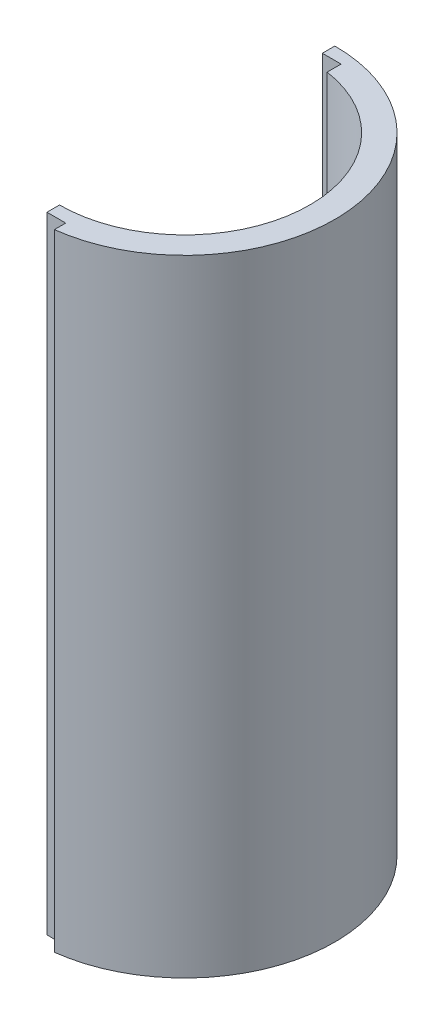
from build123d import *

# Parameters (mm, degrees)
BOSS_EXTRUDE1_DEPTH = 50
SKETCH2_W           = 1.499475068
SKETCH2_H           = 2.122779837
SKETCH2_H_2         = 2.751120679
CUT_EXTRUDE1_DEPTH  = 60


with BuildPart() as part:
    # Sketch1 → Boss-Extrude1 (new body)
    with BuildSketch(Plane(origin=(0, 0, 0), x_dir=(1, 0, 0), z_dir=(0, 1, 0))):
        with BuildLine():
            Line((0, 10), (0, 12))
            ThreePointArc((0, 12), (12, 0), (0, -12))
            Line((0, -12), (0, -10))
            ThreePointArc((0, -10), (10, 0), (0, 10))
        make_face()
    extrude(amount=BOSS_EXTRUDE1_DEPTH)

    # Sketch2 → Cut-Extrude1 (cut)
    with BuildSketch(Plane(origin=(0, 0, 0), x_dir=(1, 0, 0), z_dir=(0, 1, 0))):
        with Locations((0.749737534, 9.938610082)):
            Rectangle(SKETCH2_W, SKETCH2_H)
        with Locations((0.749737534, -12.37556034)):
            Rectangle(SKETCH2_W, SKETCH2_H_2)
    extrude(amount=CUT_EXTRUDE1_DEPTH, mode=Mode.SUBTRACT)


solid = part.part
